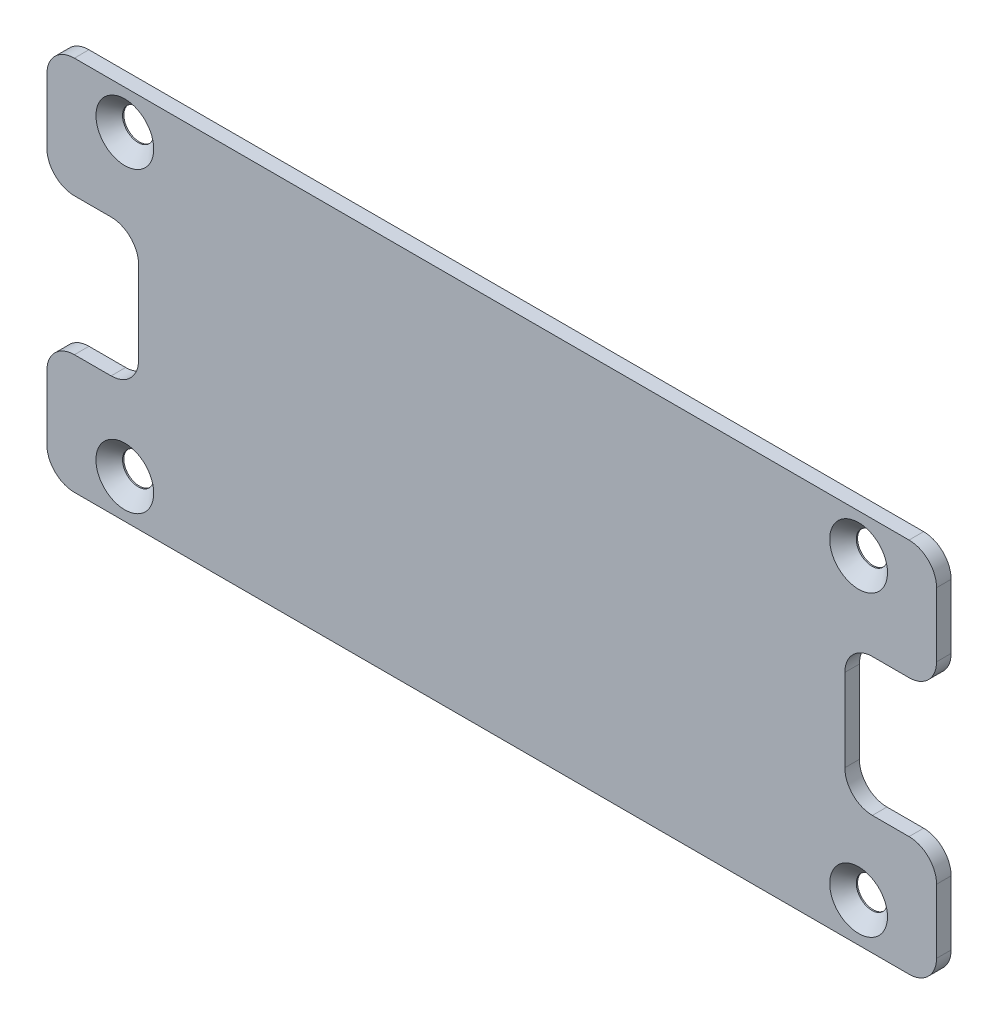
ISO-10303-21;
HEADER;
FILE_DESCRIPTION(('STEP AP214'),'2;1');
FILE_NAME('part.step','',(''),(''),'','','');
FILE_SCHEMA(('AUTOMOTIVE_DESIGN { 1 0 10303 214 1 1 1 1 }'));
ENDSEC;
DATA;
#1=APPLICATION_CONTEXT('core data for automotive mechanical design processes');
#2=APPLICATION_PROTOCOL_DEFINITION('international standard','automotive_design',2000,#1);
#3=PRODUCT_CONTEXT('',#1,'mechanical');
#4=PRODUCT('Part','Part','',(#3));
#5=PRODUCT_RELATED_PRODUCT_CATEGORY('part','',(#4));
#6=PRODUCT_DEFINITION_FORMATION('','',#4);
#7=PRODUCT_DEFINITION_CONTEXT('part definition',#1,'design');
#8=PRODUCT_DEFINITION('design','',#6,#7);
#9=PRODUCT_DEFINITION_SHAPE('','',#8);
#10=(LENGTH_UNIT() NAMED_UNIT(*) SI_UNIT(.MILLI.,.METRE.));
#11=(NAMED_UNIT(*) PLANE_ANGLE_UNIT() SI_UNIT($,.RADIAN.));
#12=(NAMED_UNIT(*) SI_UNIT($,.STERADIAN.) SOLID_ANGLE_UNIT());
#13=UNCERTAINTY_MEASURE_WITH_UNIT(LENGTH_MEASURE(1.E-05),#10,'distance_accuracy_value','');
#14=(GEOMETRIC_REPRESENTATION_CONTEXT(3) GLOBAL_UNCERTAINTY_ASSIGNED_CONTEXT((#13)) GLOBAL_UNIT_ASSIGNED_CONTEXT((#10,
#11,#12)) REPRESENTATION_CONTEXT('',''));
#15=CARTESIAN_POINT('',(0.,0.,0.));
#16=DIRECTION('',(0.,0.,1.));
#17=DIRECTION('',(1.,0.,0.));
#18=AXIS2_PLACEMENT_3D('',#15,#16,#17);
#19=CARTESIAN_POINT('',(48.5,-17.5,1.5875));
#20=DIRECTION('',(-1.,0.,0.));
#21=DIRECTION('',(0.,0.,1.));
#22=AXIS2_PLACEMENT_3D('',#19,#20,#21);
#23=PLANE('',#22);
#24=DIRECTION('',(0.,1.,0.));
#25=VECTOR('',#24,1.);
#26=CARTESIAN_POINT('',(48.5,-17.5,1.5875));
#27=LINE('',#26,#25);
#28=CARTESIAN_POINT('',(48.5,10.5,1.5875));
#29=VERTEX_POINT('',#28);
#30=CARTESIAN_POINT('',(48.5,17.5,1.5875));
#31=VERTEX_POINT('',#30);
#32=EDGE_CURVE('E209',#29,#31,#27,.T.);
#33=ORIENTED_EDGE('',*,*,#32,.F.);
#34=DIRECTION('',(0.,0.,1.));
#35=VECTOR('',#34,1.);
#36=CARTESIAN_POINT('',(48.5,10.5,1.5875));
#37=LINE('',#36,#35);
#38=CARTESIAN_POINT('',(48.5,10.5,0.));
#39=VERTEX_POINT('',#38);
#40=EDGE_CURVE('E277',#29,#39,#37,.F.);
#41=ORIENTED_EDGE('',*,*,#40,.T.);
#42=DIRECTION('',(0.,1.,0.));
#43=VECTOR('',#42,1.);
#44=CARTESIAN_POINT('',(48.5,-17.5,0.));
#45=LINE('',#44,#43);
#46=CARTESIAN_POINT('',(48.5,17.5,0.));
#47=VERTEX_POINT('',#46);
#48=EDGE_CURVE('E361',#39,#47,#45,.T.);
#49=ORIENTED_EDGE('',*,*,#48,.T.);
#50=DIRECTION('',(0.,0.,-1.));
#51=VECTOR('',#50,1.);
#52=CARTESIAN_POINT('',(48.5,17.5,1.5875));
#53=LINE('',#52,#51);
#54=EDGE_CURVE('E225',#31,#47,#53,.T.);
#55=ORIENTED_EDGE('',*,*,#54,.F.);
#56=EDGE_LOOP('',(#33,#41,#49,#55));
#57=FACE_BOUND('',#56,.T.);
#58=ADVANCED_FACE('F34',(#57),#23,.F.);
#59=CARTESIAN_POINT('',(-48.5,17.5,1.5875));
#60=DIRECTION('',(1.,0.,0.));
#61=DIRECTION('',(0.,0.,-1.));
#62=AXIS2_PLACEMENT_3D('',#59,#60,#61);
#63=PLANE('',#62);
#64=DIRECTION('',(0.,-1.,0.));
#65=VECTOR('',#64,1.);
#66=CARTESIAN_POINT('',(-48.5,17.5,0.));
#67=LINE('',#66,#65);
#68=CARTESIAN_POINT('',(-48.5,17.5,0.));
#69=VERTEX_POINT('',#68);
#70=CARTESIAN_POINT('',(-48.5,10.5,0.));
#71=VERTEX_POINT('',#70);
#72=EDGE_CURVE('E371',#69,#71,#67,.T.);
#73=ORIENTED_EDGE('',*,*,#72,.T.);
#74=DIRECTION('',(0.,0.,1.));
#75=VECTOR('',#74,1.);
#76=CARTESIAN_POINT('',(-48.5,10.5,1.5875));
#77=LINE('',#76,#75);
#78=CARTESIAN_POINT('',(-48.5,10.5,1.5875));
#79=VERTEX_POINT('',#78);
#80=EDGE_CURVE('E280',#71,#79,#77,.T.);
#81=ORIENTED_EDGE('',*,*,#80,.T.);
#82=DIRECTION('',(0.,-1.,0.));
#83=VECTOR('',#82,1.);
#84=CARTESIAN_POINT('',(-48.5,17.5,1.5875));
#85=LINE('',#84,#83);
#86=CARTESIAN_POINT('',(-48.5,17.5,1.5875));
#87=VERTEX_POINT('',#86);
#88=EDGE_CURVE('E353',#87,#79,#85,.T.);
#89=ORIENTED_EDGE('',*,*,#88,.F.);
#90=DIRECTION('',(0.,0.,-1.));
#91=VECTOR('',#90,1.);
#92=CARTESIAN_POINT('',(-48.5,17.5,1.5875));
#93=LINE('',#92,#91);
#94=EDGE_CURVE('E383',#87,#69,#93,.T.);
#95=ORIENTED_EDGE('',*,*,#94,.T.);
#96=EDGE_LOOP('',(#73,#81,#89,#95));
#97=FACE_BOUND('',#96,.T.);
#98=ADVANCED_FACE('F406',(#97),#63,.F.);
#99=CARTESIAN_POINT('',(45.5,-17.5,1.5875));
#100=DIRECTION('',(0.,0.,-1.));
#101=DIRECTION('',(-1.,0.,0.));
#102=AXIS2_PLACEMENT_3D('',#99,#100,#101);
#103=CYLINDRICAL_SURFACE('',#102,3.00000000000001);
#104=CARTESIAN_POINT('',(45.5,-17.5,0.));
#105=DIRECTION('',(0.,0.,1.));
#106=DIRECTION('',(1.,0.,0.));
#107=AXIS2_PLACEMENT_3D('',#104,#105,#106);
#108=CIRCLE('',#107,3.00000000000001);
#109=CARTESIAN_POINT('',(45.5,-20.5,0.));
#110=VERTEX_POINT('',#109);
#111=CARTESIAN_POINT('',(48.5,-17.5,0.));
#112=VERTEX_POINT('',#111);
#113=EDGE_CURVE('E223',#110,#112,#108,.T.);
#114=ORIENTED_EDGE('',*,*,#113,.T.);
#115=DIRECTION('',(0.,0.,-1.));
#116=VECTOR('',#115,1.);
#117=CARTESIAN_POINT('',(48.5,-17.5,1.5875));
#118=LINE('',#117,#116);
#119=CARTESIAN_POINT('',(48.5,-17.5,1.5875));
#120=VERTEX_POINT('',#119);
#121=EDGE_CURVE('E203',#120,#112,#118,.T.);
#122=ORIENTED_EDGE('',*,*,#121,.F.);
#123=CARTESIAN_POINT('',(45.5,-17.5,1.5875));
#124=DIRECTION('',(0.,0.,1.));
#125=DIRECTION('',(1.,0.,0.));
#126=AXIS2_PLACEMENT_3D('',#123,#124,#125);
#127=CIRCLE('',#126,3.00000000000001);
#128=CARTESIAN_POINT('',(45.5,-20.5,1.5875));
#129=VERTEX_POINT('',#128);
#130=EDGE_CURVE('E212',#129,#120,#127,.T.);
#131=ORIENTED_EDGE('',*,*,#130,.F.);
#132=DIRECTION('',(0.,0.,-1.));
#133=VECTOR('',#132,1.);
#134=CARTESIAN_POINT('',(45.5,-20.5,1.5875));
#135=LINE('',#134,#133);
#136=EDGE_CURVE('E359',#129,#110,#135,.T.);
#137=ORIENTED_EDGE('',*,*,#136,.T.);
#138=EDGE_LOOP('',(#114,#122,#131,#137));
#139=FACE_BOUND('',#138,.T.);
#140=ADVANCED_FACE('F221',(#139),#103,.T.);
#141=CARTESIAN_POINT('',(48.5,-10.5,0.));
#142=VERTEX_POINT('',#141);
#143=EDGE_CURVE('E362',#112,#142,#45,.T.);
#144=ORIENTED_EDGE('',*,*,#143,.T.);
#145=DIRECTION('',(0.,0.,1.));
#146=VECTOR('',#145,1.);
#147=CARTESIAN_POINT('',(48.5,-10.5,1.5875));
#148=LINE('',#147,#146);
#149=CARTESIAN_POINT('',(48.5,-10.5,1.5875));
#150=VERTEX_POINT('',#149);
#151=EDGE_CURVE('E206',#142,#150,#148,.T.);
#152=ORIENTED_EDGE('',*,*,#151,.T.);
#153=EDGE_CURVE('E198',#120,#150,#27,.T.);
#154=ORIENTED_EDGE('',*,*,#153,.F.);
#155=ORIENTED_EDGE('',*,*,#121,.T.);
#156=EDGE_LOOP('',(#144,#152,#154,#155));
#157=FACE_BOUND('',#156,.T.);
#158=ADVANCED_FACE('F201',(#157),#23,.F.);
#159=CARTESIAN_POINT('',(45.5,17.5,1.5875));
#160=DIRECTION('',(0.,0.,-1.));
#161=DIRECTION('',(-1.,0.,0.));
#162=AXIS2_PLACEMENT_3D('',#159,#160,#161);
#163=CYLINDRICAL_SURFACE('',#162,3.00000000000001);
#164=CARTESIAN_POINT('',(45.5,17.5,0.));
#165=DIRECTION('',(0.,0.,1.));
#166=DIRECTION('',(1.,0.,0.));
#167=AXIS2_PLACEMENT_3D('',#164,#165,#166);
#168=CIRCLE('',#167,3.00000000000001);
#169=CARTESIAN_POINT('',(45.5,20.5,0.));
#170=VERTEX_POINT('',#169);
#171=EDGE_CURVE('E364',#47,#170,#168,.T.);
#172=ORIENTED_EDGE('',*,*,#171,.T.);
#173=DIRECTION('',(0.,0.,-1.));
#174=VECTOR('',#173,1.);
#175=CARTESIAN_POINT('',(45.5,20.5,1.5875));
#176=LINE('',#175,#174);
#177=CARTESIAN_POINT('',(45.5,20.5,1.5875));
#178=VERTEX_POINT('',#177);
#179=EDGE_CURVE('E230',#178,#170,#176,.T.);
#180=ORIENTED_EDGE('',*,*,#179,.F.);
#181=CARTESIAN_POINT('',(45.5,17.5,1.5875));
#182=DIRECTION('',(0.,0.,1.));
#183=DIRECTION('',(1.,0.,0.));
#184=AXIS2_PLACEMENT_3D('',#181,#182,#183);
#185=CIRCLE('',#184,3.00000000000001);
#186=EDGE_CURVE('E208',#31,#178,#185,.T.);
#187=ORIENTED_EDGE('',*,*,#186,.F.);
#188=ORIENTED_EDGE('',*,*,#54,.T.);
#189=EDGE_LOOP('',(#172,#180,#187,#188));
#190=FACE_BOUND('',#189,.T.);
#191=ADVANCED_FACE('F411',(#190),#163,.T.);
#192=CARTESIAN_POINT('',(45.5,20.5,1.5875));
#193=DIRECTION('',(0.,-1.,0.));
#194=DIRECTION('',(0.,0.,-1.));
#195=AXIS2_PLACEMENT_3D('',#192,#193,#194);
#196=PLANE('',#195);
#197=DIRECTION('',(-1.,0.,0.));
#198=VECTOR('',#197,1.);
#199=CARTESIAN_POINT('',(45.5,20.5,0.));
#200=LINE('',#199,#198);
#201=CARTESIAN_POINT('',(-45.5,20.5,0.));
#202=VERTEX_POINT('',#201);
#203=EDGE_CURVE('E366',#170,#202,#200,.T.);
#204=ORIENTED_EDGE('',*,*,#203,.T.);
#205=DIRECTION('',(0.,0.,-1.));
#206=VECTOR('',#205,1.);
#207=CARTESIAN_POINT('',(-45.5,20.5,1.5875));
#208=LINE('',#207,#206);
#209=CARTESIAN_POINT('',(-45.5,20.5,1.5875));
#210=VERTEX_POINT('',#209);
#211=EDGE_CURVE('E386',#210,#202,#208,.T.);
#212=ORIENTED_EDGE('',*,*,#211,.F.);
#213=DIRECTION('',(-1.,0.,0.));
#214=VECTOR('',#213,1.);
#215=CARTESIAN_POINT('',(45.5,20.5,1.5875));
#216=LINE('',#215,#214);
#217=EDGE_CURVE('E348',#178,#210,#216,.T.);
#218=ORIENTED_EDGE('',*,*,#217,.F.);
#219=ORIENTED_EDGE('',*,*,#179,.T.);
#220=EDGE_LOOP('',(#204,#212,#218,#219));
#221=FACE_BOUND('',#220,.T.);
#222=ADVANCED_FACE('F393',(#221),#196,.F.);
#223=CARTESIAN_POINT('',(-45.5,17.5,1.5875));
#224=DIRECTION('',(0.,0.,-1.));
#225=DIRECTION('',(-1.,0.,0.));
#226=AXIS2_PLACEMENT_3D('',#223,#224,#225);
#227=CYLINDRICAL_SURFACE('',#226,3.00000000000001);
#228=CARTESIAN_POINT('',(-45.5,17.5,0.));
#229=DIRECTION('',(0.,0.,1.));
#230=DIRECTION('',(1.,0.,0.));
#231=AXIS2_PLACEMENT_3D('',#228,#229,#230);
#232=CIRCLE('',#231,3.00000000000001);
#233=EDGE_CURVE('E368',#202,#69,#232,.T.);
#234=ORIENTED_EDGE('',*,*,#233,.T.);
#235=ORIENTED_EDGE('',*,*,#94,.F.);
#236=CARTESIAN_POINT('',(-45.5,17.5,1.5875));
#237=DIRECTION('',(0.,0.,1.));
#238=DIRECTION('',(1.,0.,0.));
#239=AXIS2_PLACEMENT_3D('',#236,#237,#238);
#240=CIRCLE('',#239,3.00000000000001);
#241=EDGE_CURVE('E350',#210,#87,#240,.T.);
#242=ORIENTED_EDGE('',*,*,#241,.F.);
#243=ORIENTED_EDGE('',*,*,#211,.T.);
#244=EDGE_LOOP('',(#234,#235,#242,#243));
#245=FACE_BOUND('',#244,.T.);
#246=ADVANCED_FACE('F402',(#245),#227,.T.);
#247=CARTESIAN_POINT('',(-48.5,-10.5,1.5875));
#248=VERTEX_POINT('',#247);
#249=CARTESIAN_POINT('',(-48.5,-17.5,1.5875));
#250=VERTEX_POINT('',#249);
#251=EDGE_CURVE('E352',#248,#250,#85,.T.);
#252=ORIENTED_EDGE('',*,*,#251,.F.);
#253=DIRECTION('',(0.,0.,1.));
#254=VECTOR('',#253,1.);
#255=CARTESIAN_POINT('',(-48.5,-10.5,1.5875));
#256=LINE('',#255,#254);
#257=CARTESIAN_POINT('',(-48.5,-10.5,0.));
#258=VERTEX_POINT('',#257);
#259=EDGE_CURVE('E57',#248,#258,#256,.F.);
#260=ORIENTED_EDGE('',*,*,#259,.T.);
#261=CARTESIAN_POINT('',(-48.5,-17.5,0.));
#262=VERTEX_POINT('',#261);
#263=EDGE_CURVE('E370',#258,#262,#67,.T.);
#264=ORIENTED_EDGE('',*,*,#263,.T.);
#265=DIRECTION('',(0.,0.,-1.));
#266=VECTOR('',#265,1.);
#267=CARTESIAN_POINT('',(-48.5,-17.5,1.5875));
#268=LINE('',#267,#266);
#269=EDGE_CURVE('E380',#250,#262,#268,.T.);
#270=ORIENTED_EDGE('',*,*,#269,.F.);
#271=EDGE_LOOP('',(#252,#260,#264,#270));
#272=FACE_BOUND('',#271,.T.);
#273=ADVANCED_FACE('F498',(#272),#63,.F.);
#274=CARTESIAN_POINT('',(-45.5,-17.5,1.5875));
#275=DIRECTION('',(0.,0.,-1.));
#276=DIRECTION('',(-1.,0.,0.));
#277=AXIS2_PLACEMENT_3D('',#274,#275,#276);
#278=CYLINDRICAL_SURFACE('',#277,3.00000000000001);
#279=CARTESIAN_POINT('',(-45.5,-17.5,0.));
#280=DIRECTION('',(0.,0.,1.));
#281=DIRECTION('',(1.,0.,0.));
#282=AXIS2_PLACEMENT_3D('',#279,#280,#281);
#283=CIRCLE('',#282,3.00000000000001);
#284=CARTESIAN_POINT('',(-45.5,-20.5,0.));
#285=VERTEX_POINT('',#284);
#286=EDGE_CURVE('E373',#262,#285,#283,.T.);
#287=ORIENTED_EDGE('',*,*,#286,.T.);
#288=DIRECTION('',(0.,0.,-1.));
#289=VECTOR('',#288,1.);
#290=CARTESIAN_POINT('',(-45.5,-20.5,1.5875));
#291=LINE('',#290,#289);
#292=CARTESIAN_POINT('',(-45.5,-20.5,1.5875));
#293=VERTEX_POINT('',#292);
#294=EDGE_CURVE('E377',#293,#285,#291,.T.);
#295=ORIENTED_EDGE('',*,*,#294,.F.);
#296=CARTESIAN_POINT('',(-45.5,-17.5,1.5875));
#297=DIRECTION('',(0.,0.,1.));
#298=DIRECTION('',(1.,0.,0.));
#299=AXIS2_PLACEMENT_3D('',#296,#297,#298);
#300=CIRCLE('',#299,3.00000000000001);
#301=EDGE_CURVE('E356',#250,#293,#300,.T.);
#302=ORIENTED_EDGE('',*,*,#301,.F.);
#303=ORIENTED_EDGE('',*,*,#269,.T.);
#304=EDGE_LOOP('',(#287,#295,#302,#303));
#305=FACE_BOUND('',#304,.T.);
#306=ADVANCED_FACE('F558',(#305),#278,.T.);
#307=CARTESIAN_POINT('',(-45.5,-20.5,1.5875));
#308=DIRECTION('',(0.,1.,0.));
#309=DIRECTION('',(0.,0.,1.));
#310=AXIS2_PLACEMENT_3D('',#307,#308,#309);
#311=PLANE('',#310);
#312=DIRECTION('',(1.,0.,0.));
#313=VECTOR('',#312,1.);
#314=CARTESIAN_POINT('',(-45.5,-20.5,0.));
#315=LINE('',#314,#313);
#316=EDGE_CURVE('E219',#285,#110,#315,.T.);
#317=ORIENTED_EDGE('',*,*,#316,.T.);
#318=ORIENTED_EDGE('',*,*,#136,.F.);
#319=DIRECTION('',(1.,0.,0.));
#320=VECTOR('',#319,1.);
#321=CARTESIAN_POINT('',(-45.5,-20.5,1.5875));
#322=LINE('',#321,#320);
#323=EDGE_CURVE('E215',#293,#129,#322,.T.);
#324=ORIENTED_EDGE('',*,*,#323,.F.);
#325=ORIENTED_EDGE('',*,*,#294,.T.);
#326=EDGE_LOOP('',(#317,#318,#324,#325));
#327=FACE_BOUND('',#326,.T.);
#328=ADVANCED_FACE('F468',(#327),#311,.F.);
#329=CARTESIAN_POINT('',(45.5,-17.5,1.5875));
#330=DIRECTION('',(0.,0.,1.));
#331=DIRECTION('',(1.,0.,0.));
#332=AXIS2_PLACEMENT_3D('',#329,#330,#331);
#333=PLANE('',#332);
#334=CARTESIAN_POINT('',(-40.,16.25,1.5875));
#335=DIRECTION('',(0.,0.,1.));
#336=DIRECTION('',(1.,0.,0.));
#337=AXIS2_PLACEMENT_3D('',#334,#335,#336);
#338=CIRCLE('',#337,3.15);
#339=CARTESIAN_POINT('',(-36.85,16.25,1.5875));
#340=VERTEX_POINT('',#339);
#341=EDGE_CURVE('E460',#340,#340,#338,.T.);
#342=ORIENTED_EDGE('',*,*,#341,.F.);
#343=EDGE_LOOP('',(#342));
#344=FACE_BOUND('',#343,.T.);
#345=CARTESIAN_POINT('',(40.,16.25,1.5875));
#346=DIRECTION('',(0.,0.,1.));
#347=DIRECTION('',(1.,0.,0.));
#348=AXIS2_PLACEMENT_3D('',#345,#346,#347);
#349=CIRCLE('',#348,3.15);
#350=CARTESIAN_POINT('',(43.15,16.25,1.5875));
#351=VERTEX_POINT('',#350);
#352=EDGE_CURVE('E451',#351,#351,#349,.T.);
#353=ORIENTED_EDGE('',*,*,#352,.F.);
#354=EDGE_LOOP('',(#353));
#355=FACE_BOUND('',#354,.T.);
#356=CARTESIAN_POINT('',(40.,-16.25,1.5875));
#357=DIRECTION('',(0.,0.,1.));
#358=DIRECTION('',(1.,0.,0.));
#359=AXIS2_PLACEMENT_3D('',#356,#357,#358);
#360=CIRCLE('',#359,3.15);
#361=CARTESIAN_POINT('',(43.15,-16.25,1.5875));
#362=VERTEX_POINT('',#361);
#363=EDGE_CURVE('E442',#362,#362,#360,.T.);
#364=ORIENTED_EDGE('',*,*,#363,.F.);
#365=EDGE_LOOP('',(#364));
#366=FACE_BOUND('',#365,.T.);
#367=CARTESIAN_POINT('',(-40.,-16.25,1.5875));
#368=DIRECTION('',(0.,0.,1.));
#369=DIRECTION('',(1.,0.,0.));
#370=AXIS2_PLACEMENT_3D('',#367,#368,#369);
#371=CIRCLE('',#370,3.15);
#372=CARTESIAN_POINT('',(-36.85,-16.25,1.5875));
#373=VERTEX_POINT('',#372);
#374=EDGE_CURVE('E433',#373,#373,#371,.T.);
#375=ORIENTED_EDGE('',*,*,#374,.F.);
#376=EDGE_LOOP('',(#375));
#377=FACE_BOUND('',#376,.T.);
#378=ORIENTED_EDGE('',*,*,#153,.T.);
#379=CARTESIAN_POINT('',(45.5,-10.5,1.5875));
#380=DIRECTION('',(0.,0.,1.));
#381=DIRECTION('',(1.,0.,0.));
#382=AXIS2_PLACEMENT_3D('',#379,#380,#381);
#383=CIRCLE('',#382,3.);
#384=CARTESIAN_POINT('',(45.5,-7.50000000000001,1.5875));
#385=VERTEX_POINT('',#384);
#386=EDGE_CURVE('E268',#150,#385,#383,.T.);
#387=ORIENTED_EDGE('',*,*,#386,.T.);
#388=DIRECTION('',(1.,0.,0.));
#389=VECTOR('',#388,1.);
#390=CARTESIAN_POINT('',(48.5,-7.50000000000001,1.5875));
#391=LINE('',#390,#389);
#392=CARTESIAN_POINT('',(41.5,-7.50000000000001,1.5875));
#393=VERTEX_POINT('',#392);
#394=EDGE_CURVE('E299',#393,#385,#391,.T.);
#395=ORIENTED_EDGE('',*,*,#394,.F.);
#396=CARTESIAN_POINT('',(41.5,-4.50000000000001,1.5875));
#397=DIRECTION('',(0.,0.,1.));
#398=DIRECTION('',(1.,0.,0.));
#399=AXIS2_PLACEMENT_3D('',#396,#397,#398);
#400=CIRCLE('',#399,3.);
#401=CARTESIAN_POINT('',(38.5,-4.50000000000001,1.5875));
#402=VERTEX_POINT('',#401);
#403=EDGE_CURVE('E42',#393,#402,#400,.F.);
#404=ORIENTED_EDGE('',*,*,#403,.T.);
#405=DIRECTION('',(0.,-1.,0.));
#406=VECTOR('',#405,1.);
#407=CARTESIAN_POINT('',(38.5,7.50000000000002,1.5875));
#408=LINE('',#407,#406);
#409=CARTESIAN_POINT('',(38.5,4.50000000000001,1.5875));
#410=VERTEX_POINT('',#409);
#411=EDGE_CURVE('E297',#410,#402,#408,.T.);
#412=ORIENTED_EDGE('',*,*,#411,.F.);
#413=CARTESIAN_POINT('',(41.5,4.50000000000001,1.5875));
#414=DIRECTION('',(0.,0.,1.));
#415=DIRECTION('',(1.,0.,0.));
#416=AXIS2_PLACEMENT_3D('',#413,#414,#415);
#417=CIRCLE('',#416,3.);
#418=CARTESIAN_POINT('',(41.5,7.50000000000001,1.5875));
#419=VERTEX_POINT('',#418);
#420=EDGE_CURVE('E291',#410,#419,#417,.F.);
#421=ORIENTED_EDGE('',*,*,#420,.T.);
#422=DIRECTION('',(-1.,0.,0.));
#423=VECTOR('',#422,1.);
#424=CARTESIAN_POINT('',(48.5,7.5,1.5875));
#425=LINE('',#424,#423);
#426=CARTESIAN_POINT('',(45.5,7.5,1.5875));
#427=VERTEX_POINT('',#426);
#428=EDGE_CURVE('E308',#427,#419,#425,.T.);
#429=ORIENTED_EDGE('',*,*,#428,.F.);
#430=CARTESIAN_POINT('',(45.5,10.5,1.5875));
#431=DIRECTION('',(0.,0.,1.));
#432=DIRECTION('',(1.,0.,0.));
#433=AXIS2_PLACEMENT_3D('',#430,#431,#432);
#434=CIRCLE('',#433,3.);
#435=EDGE_CURVE('E266',#427,#29,#434,.T.);
#436=ORIENTED_EDGE('',*,*,#435,.T.);
#437=ORIENTED_EDGE('',*,*,#32,.T.);
#438=ORIENTED_EDGE('',*,*,#186,.T.);
#439=ORIENTED_EDGE('',*,*,#217,.T.);
#440=ORIENTED_EDGE('',*,*,#241,.T.);
#441=ORIENTED_EDGE('',*,*,#88,.T.);
#442=CARTESIAN_POINT('',(-45.5,10.5,1.5875));
#443=DIRECTION('',(0.,0.,1.));
#444=DIRECTION('',(1.,0.,0.));
#445=AXIS2_PLACEMENT_3D('',#442,#443,#444);
#446=CIRCLE('',#445,3.);
#447=CARTESIAN_POINT('',(-45.5,7.49999999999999,1.5875));
#448=VERTEX_POINT('',#447);
#449=EDGE_CURVE('E262',#79,#448,#446,.T.);
#450=ORIENTED_EDGE('',*,*,#449,.T.);
#451=DIRECTION('',(-1.,0.,0.));
#452=VECTOR('',#451,1.);
#453=CARTESIAN_POINT('',(-48.5,7.5,1.5875));
#454=LINE('',#453,#452);
#455=CARTESIAN_POINT('',(-41.5,7.49999999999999,1.5875));
#456=VERTEX_POINT('',#455);
#457=EDGE_CURVE('E338',#456,#448,#454,.T.);
#458=ORIENTED_EDGE('',*,*,#457,.F.);
#459=CARTESIAN_POINT('',(-41.5,4.49999999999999,1.5875));
#460=DIRECTION('',(0.,0.,1.));
#461=DIRECTION('',(1.,0.,0.));
#462=AXIS2_PLACEMENT_3D('',#459,#460,#461);
#463=CIRCLE('',#462,3.);
#464=CARTESIAN_POINT('',(-38.5,4.49999999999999,1.5875));
#465=VERTEX_POINT('',#464);
#466=EDGE_CURVE('E287',#456,#465,#463,.F.);
#467=ORIENTED_EDGE('',*,*,#466,.T.);
#468=DIRECTION('',(0.,1.,0.));
#469=VECTOR('',#468,1.);
#470=CARTESIAN_POINT('',(-38.5,7.49999999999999,1.5875));
#471=LINE('',#470,#469);
#472=CARTESIAN_POINT('',(-38.5,-4.50000000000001,1.5875));
#473=VERTEX_POINT('',#472);
#474=EDGE_CURVE('E324',#473,#465,#471,.T.);
#475=ORIENTED_EDGE('',*,*,#474,.F.);
#476=CARTESIAN_POINT('',(-41.5,-4.50000000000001,1.5875));
#477=DIRECTION('',(0.,0.,1.));
#478=DIRECTION('',(1.,0.,0.));
#479=AXIS2_PLACEMENT_3D('',#476,#477,#478);
#480=CIRCLE('',#479,3.);
#481=CARTESIAN_POINT('',(-41.5,-7.50000000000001,1.5875));
#482=VERTEX_POINT('',#481);
#483=EDGE_CURVE('E283',#473,#482,#480,.F.);
#484=ORIENTED_EDGE('',*,*,#483,.T.);
#485=DIRECTION('',(1.,0.,0.));
#486=VECTOR('',#485,1.);
#487=CARTESIAN_POINT('',(-48.5,-7.50000000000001,1.5875));
#488=LINE('',#487,#486);
#489=CARTESIAN_POINT('',(-45.5,-7.50000000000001,1.5875));
#490=VERTEX_POINT('',#489);
#491=EDGE_CURVE('E321',#490,#482,#488,.T.);
#492=ORIENTED_EDGE('',*,*,#491,.F.);
#493=CARTESIAN_POINT('',(-45.5,-10.5,1.5875));
#494=DIRECTION('',(0.,0.,1.));
#495=DIRECTION('',(1.,0.,0.));
#496=AXIS2_PLACEMENT_3D('',#493,#494,#495);
#497=CIRCLE('',#496,3.);
#498=EDGE_CURVE('E264',#490,#248,#497,.T.);
#499=ORIENTED_EDGE('',*,*,#498,.T.);
#500=ORIENTED_EDGE('',*,*,#251,.T.);
#501=ORIENTED_EDGE('',*,*,#301,.T.);
#502=ORIENTED_EDGE('',*,*,#323,.T.);
#503=ORIENTED_EDGE('',*,*,#130,.T.);
#504=EDGE_LOOP('',(#378,#387,#395,#404,#412,#421,#429,#436,#437,#438,#439,#440,#441,#450,#458,
#467,#475,#484,#492,#499,#500,#501,#502,#503));
#505=FACE_BOUND('',#504,.T.);
#506=ADVANCED_FACE('F213',(#344,#355,#366,#377,#505),#333,.T.);
#507=CARTESIAN_POINT('',(45.5,-17.5,0.));
#508=DIRECTION('',(0.,0.,1.));
#509=DIRECTION('',(1.,0.,0.));
#510=AXIS2_PLACEMENT_3D('',#507,#508,#509);
#511=PLANE('',#510);
#512=CARTESIAN_POINT('',(-40.,16.25,0.));
#513=DIRECTION('',(0.,0.,1.));
#514=DIRECTION('',(1.,0.,0.));
#515=AXIS2_PLACEMENT_3D('',#512,#513,#514);
#516=CIRCLE('',#515,1.7);
#517=CARTESIAN_POINT('',(-38.3,16.25,0.));
#518=VERTEX_POINT('',#517);
#519=EDGE_CURVE('E454',#518,#518,#516,.T.);
#520=ORIENTED_EDGE('',*,*,#519,.T.);
#521=EDGE_LOOP('',(#520));
#522=FACE_BOUND('',#521,.T.);
#523=CARTESIAN_POINT('',(40.,16.25,0.));
#524=DIRECTION('',(0.,0.,1.));
#525=DIRECTION('',(1.,0.,0.));
#526=AXIS2_PLACEMENT_3D('',#523,#524,#525);
#527=CIRCLE('',#526,1.7);
#528=CARTESIAN_POINT('',(41.7,16.25,0.));
#529=VERTEX_POINT('',#528);
#530=EDGE_CURVE('E445',#529,#529,#527,.T.);
#531=ORIENTED_EDGE('',*,*,#530,.T.);
#532=EDGE_LOOP('',(#531));
#533=FACE_BOUND('',#532,.T.);
#534=CARTESIAN_POINT('',(40.,-16.25,0.));
#535=DIRECTION('',(0.,0.,1.));
#536=DIRECTION('',(1.,0.,0.));
#537=AXIS2_PLACEMENT_3D('',#534,#535,#536);
#538=CIRCLE('',#537,1.7);
#539=CARTESIAN_POINT('',(41.7,-16.25,0.));
#540=VERTEX_POINT('',#539);
#541=EDGE_CURVE('E436',#540,#540,#538,.T.);
#542=ORIENTED_EDGE('',*,*,#541,.T.);
#543=EDGE_LOOP('',(#542));
#544=FACE_BOUND('',#543,.T.);
#545=CARTESIAN_POINT('',(-40.,-16.25,0.));
#546=DIRECTION('',(0.,0.,1.));
#547=DIRECTION('',(1.,0.,0.));
#548=AXIS2_PLACEMENT_3D('',#545,#546,#547);
#549=CIRCLE('',#548,1.7);
#550=CARTESIAN_POINT('',(-38.3,-16.25,0.));
#551=VERTEX_POINT('',#550);
#552=EDGE_CURVE('E331',#551,#551,#549,.T.);
#553=ORIENTED_EDGE('',*,*,#552,.T.);
#554=EDGE_LOOP('',(#553));
#555=FACE_BOUND('',#554,.T.);
#556=DIRECTION('',(1.,0.,0.));
#557=VECTOR('',#556,1.);
#558=CARTESIAN_POINT('',(48.5,-7.50000000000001,0.));
#559=LINE('',#558,#557);
#560=CARTESIAN_POINT('',(41.5,-7.50000000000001,0.));
#561=VERTEX_POINT('',#560);
#562=CARTESIAN_POINT('',(45.5,-7.50000000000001,0.));
#563=VERTEX_POINT('',#562);
#564=EDGE_CURVE('E315',#561,#563,#559,.T.);
#565=ORIENTED_EDGE('',*,*,#564,.T.);
#566=CARTESIAN_POINT('',(45.5,-10.5,0.));
#567=DIRECTION('',(0.,0.,1.));
#568=DIRECTION('',(1.,0.,0.));
#569=AXIS2_PLACEMENT_3D('',#566,#567,#568);
#570=CIRCLE('',#569,3.);
#571=EDGE_CURVE('E275',#563,#142,#570,.F.);
#572=ORIENTED_EDGE('',*,*,#571,.T.);
#573=ORIENTED_EDGE('',*,*,#143,.F.);
#574=ORIENTED_EDGE('',*,*,#113,.F.);
#575=ORIENTED_EDGE('',*,*,#316,.F.);
#576=ORIENTED_EDGE('',*,*,#286,.F.);
#577=ORIENTED_EDGE('',*,*,#263,.F.);
#578=CARTESIAN_POINT('',(-45.5,-10.5,0.));
#579=DIRECTION('',(0.,0.,1.));
#580=DIRECTION('',(1.,0.,0.));
#581=AXIS2_PLACEMENT_3D('',#578,#579,#580);
#582=CIRCLE('',#581,3.);
#583=CARTESIAN_POINT('',(-45.5,-7.50000000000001,0.));
#584=VERTEX_POINT('',#583);
#585=EDGE_CURVE('E271',#258,#584,#582,.F.);
#586=ORIENTED_EDGE('',*,*,#585,.T.);
#587=DIRECTION('',(1.,0.,0.));
#588=VECTOR('',#587,1.);
#589=CARTESIAN_POINT('',(-48.5,-7.50000000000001,0.));
#590=LINE('',#589,#588);
#591=CARTESIAN_POINT('',(-41.5,-7.50000000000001,0.));
#592=VERTEX_POINT('',#591);
#593=EDGE_CURVE('E334',#584,#592,#590,.T.);
#594=ORIENTED_EDGE('',*,*,#593,.T.);
#595=CARTESIAN_POINT('',(-41.5,-4.50000000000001,0.));
#596=DIRECTION('',(0.,0.,1.));
#597=DIRECTION('',(1.,0.,0.));
#598=AXIS2_PLACEMENT_3D('',#595,#596,#597);
#599=CIRCLE('',#598,3.);
#600=CARTESIAN_POINT('',(-38.5,-4.50000000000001,0.));
#601=VERTEX_POINT('',#600);
#602=EDGE_CURVE('E285',#592,#601,#599,.T.);
#603=ORIENTED_EDGE('',*,*,#602,.T.);
#604=DIRECTION('',(0.,1.,0.));
#605=VECTOR('',#604,1.);
#606=CARTESIAN_POINT('',(-38.5,7.49999999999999,0.));
#607=LINE('',#606,#605);
#608=CARTESIAN_POINT('',(-38.5,4.49999999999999,0.));
#609=VERTEX_POINT('',#608);
#610=EDGE_CURVE('E337',#601,#609,#607,.T.);
#611=ORIENTED_EDGE('',*,*,#610,.T.);
#612=CARTESIAN_POINT('',(-41.5,4.49999999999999,0.));
#613=DIRECTION('',(0.,0.,1.));
#614=DIRECTION('',(1.,0.,0.));
#615=AXIS2_PLACEMENT_3D('',#612,#613,#614);
#616=CIRCLE('',#615,3.);
#617=CARTESIAN_POINT('',(-41.5,7.49999999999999,0.));
#618=VERTEX_POINT('',#617);
#619=EDGE_CURVE('E289',#609,#618,#616,.T.);
#620=ORIENTED_EDGE('',*,*,#619,.T.);
#621=DIRECTION('',(-1.,0.,0.));
#622=VECTOR('',#621,1.);
#623=CARTESIAN_POINT('',(-48.5,7.5,0.));
#624=LINE('',#623,#622);
#625=CARTESIAN_POINT('',(-45.5,7.49999999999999,0.));
#626=VERTEX_POINT('',#625);
#627=EDGE_CURVE('E341',#618,#626,#624,.T.);
#628=ORIENTED_EDGE('',*,*,#627,.T.);
#629=CARTESIAN_POINT('',(-45.5,10.5,0.));
#630=DIRECTION('',(0.,0.,1.));
#631=DIRECTION('',(1.,0.,0.));
#632=AXIS2_PLACEMENT_3D('',#629,#630,#631);
#633=CIRCLE('',#632,3.);
#634=EDGE_CURVE('E49',#626,#71,#633,.F.);
#635=ORIENTED_EDGE('',*,*,#634,.T.);
#636=ORIENTED_EDGE('',*,*,#72,.F.);
#637=ORIENTED_EDGE('',*,*,#233,.F.);
#638=ORIENTED_EDGE('',*,*,#203,.F.);
#639=ORIENTED_EDGE('',*,*,#171,.F.);
#640=ORIENTED_EDGE('',*,*,#48,.F.);
#641=CARTESIAN_POINT('',(45.5,10.5,0.));
#642=DIRECTION('',(0.,0.,1.));
#643=DIRECTION('',(1.,0.,0.));
#644=AXIS2_PLACEMENT_3D('',#641,#642,#643);
#645=CIRCLE('',#644,3.);
#646=CARTESIAN_POINT('',(45.5,7.5,0.));
#647=VERTEX_POINT('',#646);
#648=EDGE_CURVE('E273',#39,#647,#645,.F.);
#649=ORIENTED_EDGE('',*,*,#648,.T.);
#650=DIRECTION('',(-1.,0.,0.));
#651=VECTOR('',#650,1.);
#652=CARTESIAN_POINT('',(48.5,7.5,0.));
#653=LINE('',#652,#651);
#654=CARTESIAN_POINT('',(41.5,7.50000000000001,0.));
#655=VERTEX_POINT('',#654);
#656=EDGE_CURVE('E326',#647,#655,#653,.T.);
#657=ORIENTED_EDGE('',*,*,#656,.T.);
#658=CARTESIAN_POINT('',(41.5,4.50000000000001,0.));
#659=DIRECTION('',(0.,0.,1.));
#660=DIRECTION('',(1.,0.,0.));
#661=AXIS2_PLACEMENT_3D('',#658,#659,#660);
#662=CIRCLE('',#661,3.);
#663=CARTESIAN_POINT('',(38.5,4.50000000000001,0.));
#664=VERTEX_POINT('',#663);
#665=EDGE_CURVE('E293',#655,#664,#662,.T.);
#666=ORIENTED_EDGE('',*,*,#665,.T.);
#667=DIRECTION('',(0.,-1.,0.));
#668=VECTOR('',#667,1.);
#669=CARTESIAN_POINT('',(38.5,7.50000000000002,0.));
#670=LINE('',#669,#668);
#671=CARTESIAN_POINT('',(38.5,-4.50000000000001,0.));
#672=VERTEX_POINT('',#671);
#673=EDGE_CURVE('E317',#664,#672,#670,.T.);
#674=ORIENTED_EDGE('',*,*,#673,.T.);
#675=CARTESIAN_POINT('',(41.5,-4.50000000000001,0.));
#676=DIRECTION('',(0.,0.,1.));
#677=DIRECTION('',(1.,0.,0.));
#678=AXIS2_PLACEMENT_3D('',#675,#676,#677);
#679=CIRCLE('',#678,3.);
#680=EDGE_CURVE('E11',#672,#561,#679,.T.);
#681=ORIENTED_EDGE('',*,*,#680,.T.);
#682=EDGE_LOOP('',(#565,#572,#573,#574,#575,#576,#577,#586,#594,#603,#611,#620,#628,#635,#636,
#637,#638,#639,#640,#649,#657,#666,#674,#681));
#683=FACE_BOUND('',#682,.T.);
#684=ADVANCED_FACE('F314',(#522,#533,#544,#555,#683),#511,.F.);
#685=CARTESIAN_POINT('',(-48.5,7.5,0.));
#686=DIRECTION('',(0.,1.,0.));
#687=DIRECTION('',(-1.,0.,0.));
#688=AXIS2_PLACEMENT_3D('',#685,#686,#687);
#689=PLANE('',#688);
#690=ORIENTED_EDGE('',*,*,#627,.F.);
#691=DIRECTION('',(0.,0.,1.));
#692=VECTOR('',#691,1.);
#693=CARTESIAN_POINT('',(-41.5,7.49999999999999,1.5875));
#694=LINE('',#693,#692);
#695=EDGE_CURVE('E243',#618,#456,#694,.T.);
#696=ORIENTED_EDGE('',*,*,#695,.T.);
#697=ORIENTED_EDGE('',*,*,#457,.T.);
#698=DIRECTION('',(0.,0.,1.));
#699=VECTOR('',#698,1.);
#700=CARTESIAN_POINT('',(-45.5,7.49999999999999,0.));
#701=LINE('',#700,#699);
#702=EDGE_CURVE('E241',#448,#626,#701,.F.);
#703=ORIENTED_EDGE('',*,*,#702,.T.);
#704=EDGE_LOOP('',(#690,#696,#697,#703));
#705=FACE_BOUND('',#704,.T.);
#706=ADVANCED_FACE('F552',(#705),#689,.F.);
#707=CARTESIAN_POINT('',(-38.5,7.49999999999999,0.));
#708=DIRECTION('',(1.,0.,0.));
#709=DIRECTION('',(0.,0.,-1.));
#710=AXIS2_PLACEMENT_3D('',#707,#708,#709);
#711=PLANE('',#710);
#712=ORIENTED_EDGE('',*,*,#610,.F.);
#713=DIRECTION('',(0.,0.,1.));
#714=VECTOR('',#713,1.);
#715=CARTESIAN_POINT('',(-38.5,-4.50000000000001,1.5875));
#716=LINE('',#715,#714);
#717=EDGE_CURVE('E227',#601,#473,#716,.T.);
#718=ORIENTED_EDGE('',*,*,#717,.T.);
#719=ORIENTED_EDGE('',*,*,#474,.T.);
#720=DIRECTION('',(0.,0.,1.));
#721=VECTOR('',#720,1.);
#722=CARTESIAN_POINT('',(-38.5,4.49999999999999,0.));
#723=LINE('',#722,#721);
#724=EDGE_CURVE('E224',#465,#609,#723,.F.);
#725=ORIENTED_EDGE('',*,*,#724,.T.);
#726=EDGE_LOOP('',(#712,#718,#719,#725));
#727=FACE_BOUND('',#726,.T.);
#728=ADVANCED_FACE('F546',(#727),#711,.F.);
#729=CARTESIAN_POINT('',(-48.5,-7.50000000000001,0.));
#730=DIRECTION('',(0.,-1.,0.));
#731=DIRECTION('',(0.,0.,-1.));
#732=AXIS2_PLACEMENT_3D('',#729,#730,#731);
#733=PLANE('',#732);
#734=ORIENTED_EDGE('',*,*,#491,.T.);
#735=DIRECTION('',(0.,0.,1.));
#736=VECTOR('',#735,1.);
#737=CARTESIAN_POINT('',(-41.5,-7.50000000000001,0.));
#738=LINE('',#737,#736);
#739=EDGE_CURVE('E239',#482,#592,#738,.F.);
#740=ORIENTED_EDGE('',*,*,#739,.T.);
#741=ORIENTED_EDGE('',*,*,#593,.F.);
#742=DIRECTION('',(0.,0.,1.));
#743=VECTOR('',#742,1.);
#744=CARTESIAN_POINT('',(-45.5,-7.50000000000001,0.));
#745=LINE('',#744,#743);
#746=EDGE_CURVE('E236',#584,#490,#745,.T.);
#747=ORIENTED_EDGE('',*,*,#746,.T.);
#748=EDGE_LOOP('',(#734,#740,#741,#747));
#749=FACE_BOUND('',#748,.T.);
#750=ADVANCED_FACE('F539',(#749),#733,.F.);
#751=CARTESIAN_POINT('',(48.5,7.5,0.));
#752=DIRECTION('',(0.,1.,0.));
#753=DIRECTION('',(-1.,0.,0.));
#754=AXIS2_PLACEMENT_3D('',#751,#752,#753);
#755=PLANE('',#754);
#756=ORIENTED_EDGE('',*,*,#428,.T.);
#757=DIRECTION('',(0.,0.,1.));
#758=VECTOR('',#757,1.);
#759=CARTESIAN_POINT('',(41.5,7.50000000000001,0.));
#760=LINE('',#759,#758);
#761=EDGE_CURVE('E254',#419,#655,#760,.F.);
#762=ORIENTED_EDGE('',*,*,#761,.T.);
#763=ORIENTED_EDGE('',*,*,#656,.F.);
#764=DIRECTION('',(0.,0.,1.));
#765=VECTOR('',#764,1.);
#766=CARTESIAN_POINT('',(45.5,7.5,0.));
#767=LINE('',#766,#765);
#768=EDGE_CURVE('E251',#647,#427,#767,.T.);
#769=ORIENTED_EDGE('',*,*,#768,.T.);
#770=EDGE_LOOP('',(#756,#762,#763,#769));
#771=FACE_BOUND('',#770,.T.);
#772=ADVANCED_FACE('F422',(#771),#755,.F.);
#773=CARTESIAN_POINT('',(48.5,-7.50000000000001,0.));
#774=DIRECTION('',(0.,-1.,0.));
#775=DIRECTION('',(0.,0.,-1.));
#776=AXIS2_PLACEMENT_3D('',#773,#774,#775);
#777=PLANE('',#776);
#778=ORIENTED_EDGE('',*,*,#564,.F.);
#779=DIRECTION('',(0.,0.,1.));
#780=VECTOR('',#779,1.);
#781=CARTESIAN_POINT('',(41.5,-7.50000000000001,1.5875));
#782=LINE('',#781,#780);
#783=EDGE_CURVE('E258',#561,#393,#782,.T.);
#784=ORIENTED_EDGE('',*,*,#783,.T.);
#785=ORIENTED_EDGE('',*,*,#394,.T.);
#786=DIRECTION('',(0.,0.,1.));
#787=VECTOR('',#786,1.);
#788=CARTESIAN_POINT('',(45.5,-7.50000000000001,0.));
#789=LINE('',#788,#787);
#790=EDGE_CURVE('E256',#385,#563,#789,.F.);
#791=ORIENTED_EDGE('',*,*,#790,.T.);
#792=EDGE_LOOP('',(#778,#784,#785,#791));
#793=FACE_BOUND('',#792,.T.);
#794=ADVANCED_FACE('F319',(#793),#777,.F.);
#795=CARTESIAN_POINT('',(38.5,7.50000000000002,0.));
#796=DIRECTION('',(-1.,0.,0.));
#797=DIRECTION('',(0.,0.,1.));
#798=AXIS2_PLACEMENT_3D('',#795,#796,#797);
#799=PLANE('',#798);
#800=ORIENTED_EDGE('',*,*,#673,.F.);
#801=DIRECTION('',(0.,0.,1.));
#802=VECTOR('',#801,1.);
#803=CARTESIAN_POINT('',(38.5,4.50000000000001,1.5875));
#804=LINE('',#803,#802);
#805=EDGE_CURVE('E248',#664,#410,#804,.T.);
#806=ORIENTED_EDGE('',*,*,#805,.T.);
#807=ORIENTED_EDGE('',*,*,#411,.T.);
#808=DIRECTION('',(0.,0.,1.));
#809=VECTOR('',#808,1.);
#810=CARTESIAN_POINT('',(38.5,-4.50000000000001,0.));
#811=LINE('',#810,#809);
#812=EDGE_CURVE('E246',#402,#672,#811,.F.);
#813=ORIENTED_EDGE('',*,*,#812,.T.);
#814=EDGE_LOOP('',(#800,#806,#807,#813));
#815=FACE_BOUND('',#814,.T.);
#816=ADVANCED_FACE('F305',(#815),#799,.F.);
#817=CARTESIAN_POINT('',(-40.,-16.25,1.5875));
#818=DIRECTION('',(0.,0.,1.));
#819=DIRECTION('',(1.,0.,0.));
#820=AXIS2_PLACEMENT_3D('',#817,#818,#819);
#821=CYLINDRICAL_SURFACE('',#820,1.7);
#822=ORIENTED_EDGE('',*,*,#552,.F.);
#823=EDGE_LOOP('',(#822));
#824=FACE_BOUND('',#823,.T.);
#825=CARTESIAN_POINT('',(-40.,-16.25,0.137500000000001));
#826=DIRECTION('',(0.,0.,1.));
#827=DIRECTION('',(1.,0.,0.));
#828=AXIS2_PLACEMENT_3D('',#825,#826,#827);
#829=CIRCLE('',#828,1.7);
#830=CARTESIAN_POINT('',(-38.3,-16.25,0.137500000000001));
#831=VERTEX_POINT('',#830);
#832=EDGE_CURVE('E430',#831,#831,#829,.T.);
#833=ORIENTED_EDGE('',*,*,#832,.T.);
#834=EDGE_LOOP('',(#833));
#835=FACE_BOUND('',#834,.T.);
#836=ADVANCED_FACE('F479',(#824,#835),#821,.F.);
#837=CARTESIAN_POINT('',(-40.,-16.25,1.5875));
#838=DIRECTION('',(0.,0.,1.));
#839=DIRECTION('',(1.,0.,0.));
#840=AXIS2_PLACEMENT_3D('',#837,#838,#839);
#841=CONICAL_SURFACE('',#840,3.15,0.785398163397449);
#842=ORIENTED_EDGE('',*,*,#832,.F.);
#843=EDGE_LOOP('',(#842));
#844=FACE_BOUND('',#843,.T.);
#845=ORIENTED_EDGE('',*,*,#374,.T.);
#846=EDGE_LOOP('',(#845));
#847=FACE_BOUND('',#846,.T.);
#848=ADVANCED_FACE('F476',(#844,#847),#841,.F.);
#849=CARTESIAN_POINT('',(40.,-16.25,1.5875));
#850=DIRECTION('',(0.,0.,1.));
#851=DIRECTION('',(1.,0.,0.));
#852=AXIS2_PLACEMENT_3D('',#849,#850,#851);
#853=CYLINDRICAL_SURFACE('',#852,1.7);
#854=ORIENTED_EDGE('',*,*,#541,.F.);
#855=EDGE_LOOP('',(#854));
#856=FACE_BOUND('',#855,.T.);
#857=CARTESIAN_POINT('',(40.,-16.25,0.137500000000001));
#858=DIRECTION('',(0.,0.,1.));
#859=DIRECTION('',(1.,0.,0.));
#860=AXIS2_PLACEMENT_3D('',#857,#858,#859);
#861=CIRCLE('',#860,1.7);
#862=CARTESIAN_POINT('',(41.7,-16.25,0.137500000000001));
#863=VERTEX_POINT('',#862);
#864=EDGE_CURVE('E439',#863,#863,#861,.T.);
#865=ORIENTED_EDGE('',*,*,#864,.T.);
#866=EDGE_LOOP('',(#865));
#867=FACE_BOUND('',#866,.T.);
#868=ADVANCED_FACE('F478',(#856,#867),#853,.F.);
#869=CARTESIAN_POINT('',(40.,-16.25,1.5875));
#870=DIRECTION('',(0.,0.,1.));
#871=DIRECTION('',(1.,0.,0.));
#872=AXIS2_PLACEMENT_3D('',#869,#870,#871);
#873=CONICAL_SURFACE('',#872,3.15,0.785398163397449);
#874=ORIENTED_EDGE('',*,*,#864,.F.);
#875=EDGE_LOOP('',(#874));
#876=FACE_BOUND('',#875,.T.);
#877=ORIENTED_EDGE('',*,*,#363,.T.);
#878=EDGE_LOOP('',(#877));
#879=FACE_BOUND('',#878,.T.);
#880=ADVANCED_FACE('F486',(#876,#879),#873,.F.);
#881=CARTESIAN_POINT('',(40.,16.25,1.5875));
#882=DIRECTION('',(0.,0.,1.));
#883=DIRECTION('',(1.,0.,0.));
#884=AXIS2_PLACEMENT_3D('',#881,#882,#883);
#885=CYLINDRICAL_SURFACE('',#884,1.7);
#886=ORIENTED_EDGE('',*,*,#530,.F.);
#887=EDGE_LOOP('',(#886));
#888=FACE_BOUND('',#887,.T.);
#889=CARTESIAN_POINT('',(40.,16.25,0.137500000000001));
#890=DIRECTION('',(0.,0.,1.));
#891=DIRECTION('',(1.,0.,0.));
#892=AXIS2_PLACEMENT_3D('',#889,#890,#891);
#893=CIRCLE('',#892,1.7);
#894=CARTESIAN_POINT('',(41.7,16.25,0.137500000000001));
#895=VERTEX_POINT('',#894);
#896=EDGE_CURVE('E448',#895,#895,#893,.T.);
#897=ORIENTED_EDGE('',*,*,#896,.T.);
#898=EDGE_LOOP('',(#897));
#899=FACE_BOUND('',#898,.T.);
#900=ADVANCED_FACE('F622',(#888,#899),#885,.F.);
#901=CARTESIAN_POINT('',(40.,16.25,1.5875));
#902=DIRECTION('',(0.,0.,1.));
#903=DIRECTION('',(1.,0.,0.));
#904=AXIS2_PLACEMENT_3D('',#901,#902,#903);
#905=CONICAL_SURFACE('',#904,3.15,0.785398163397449);
#906=ORIENTED_EDGE('',*,*,#896,.F.);
#907=EDGE_LOOP('',(#906));
#908=FACE_BOUND('',#907,.T.);
#909=ORIENTED_EDGE('',*,*,#352,.T.);
#910=EDGE_LOOP('',(#909));
#911=FACE_BOUND('',#910,.T.);
#912=ADVANCED_FACE('F632',(#908,#911),#905,.F.);
#913=CARTESIAN_POINT('',(-40.,16.25,1.5875));
#914=DIRECTION('',(0.,0.,1.));
#915=DIRECTION('',(1.,0.,0.));
#916=AXIS2_PLACEMENT_3D('',#913,#914,#915);
#917=CYLINDRICAL_SURFACE('',#916,1.7);
#918=ORIENTED_EDGE('',*,*,#519,.F.);
#919=EDGE_LOOP('',(#918));
#920=FACE_BOUND('',#919,.T.);
#921=CARTESIAN_POINT('',(-40.,16.25,0.137500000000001));
#922=DIRECTION('',(0.,0.,1.));
#923=DIRECTION('',(1.,0.,0.));
#924=AXIS2_PLACEMENT_3D('',#921,#922,#923);
#925=CIRCLE('',#924,1.7);
#926=CARTESIAN_POINT('',(-38.3,16.25,0.137500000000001));
#927=VERTEX_POINT('',#926);
#928=EDGE_CURVE('E457',#927,#927,#925,.T.);
#929=ORIENTED_EDGE('',*,*,#928,.T.);
#930=EDGE_LOOP('',(#929));
#931=FACE_BOUND('',#930,.T.);
#932=ADVANCED_FACE('F642',(#920,#931),#917,.F.);
#933=CARTESIAN_POINT('',(-40.,16.25,1.5875));
#934=DIRECTION('',(0.,0.,1.));
#935=DIRECTION('',(1.,0.,0.));
#936=AXIS2_PLACEMENT_3D('',#933,#934,#935);
#937=CONICAL_SURFACE('',#936,3.15,0.785398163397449);
#938=ORIENTED_EDGE('',*,*,#928,.F.);
#939=EDGE_LOOP('',(#938));
#940=FACE_BOUND('',#939,.T.);
#941=ORIENTED_EDGE('',*,*,#341,.T.);
#942=EDGE_LOOP('',(#941));
#943=FACE_BOUND('',#942,.T.);
#944=ADVANCED_FACE('F464',(#940,#943),#937,.F.);
#945=CARTESIAN_POINT('',(-41.5,-4.50000000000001,0.));
#946=DIRECTION('',(0.,0.,-1.));
#947=DIRECTION('',(-1.,0.,0.));
#948=AXIS2_PLACEMENT_3D('',#945,#946,#947);
#949=CYLINDRICAL_SURFACE('',#948,3.);
#950=ORIENTED_EDGE('',*,*,#602,.F.);
#951=ORIENTED_EDGE('',*,*,#739,.F.);
#952=ORIENTED_EDGE('',*,*,#483,.F.);
#953=ORIENTED_EDGE('',*,*,#717,.F.);
#954=EDGE_LOOP('',(#950,#951,#952,#953));
#955=FACE_BOUND('',#954,.T.);
#956=ADVANCED_FACE('F509',(#955),#949,.F.);
#957=CARTESIAN_POINT('',(-41.5,4.49999999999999,0.));
#958=DIRECTION('',(0.,0.,-1.));
#959=DIRECTION('',(-1.,0.,0.));
#960=AXIS2_PLACEMENT_3D('',#957,#958,#959);
#961=CYLINDRICAL_SURFACE('',#960,3.);
#962=ORIENTED_EDGE('',*,*,#619,.F.);
#963=ORIENTED_EDGE('',*,*,#724,.F.);
#964=ORIENTED_EDGE('',*,*,#466,.F.);
#965=ORIENTED_EDGE('',*,*,#695,.F.);
#966=EDGE_LOOP('',(#962,#963,#964,#965));
#967=FACE_BOUND('',#966,.T.);
#968=ADVANCED_FACE('F512',(#967),#961,.F.);
#969=CARTESIAN_POINT('',(41.5,4.50000000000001,0.));
#970=DIRECTION('',(0.,0.,-1.));
#971=DIRECTION('',(-1.,0.,0.));
#972=AXIS2_PLACEMENT_3D('',#969,#970,#971);
#973=CYLINDRICAL_SURFACE('',#972,3.);
#974=ORIENTED_EDGE('',*,*,#665,.F.);
#975=ORIENTED_EDGE('',*,*,#761,.F.);
#976=ORIENTED_EDGE('',*,*,#420,.F.);
#977=ORIENTED_EDGE('',*,*,#805,.F.);
#978=EDGE_LOOP('',(#974,#975,#976,#977));
#979=FACE_BOUND('',#978,.T.);
#980=ADVANCED_FACE('F426',(#979),#973,.F.);
#981=CARTESIAN_POINT('',(41.5,-4.50000000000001,0.));
#982=DIRECTION('',(0.,0.,-1.));
#983=DIRECTION('',(-1.,0.,0.));
#984=AXIS2_PLACEMENT_3D('',#981,#982,#983);
#985=CYLINDRICAL_SURFACE('',#984,3.);
#986=ORIENTED_EDGE('',*,*,#680,.F.);
#987=ORIENTED_EDGE('',*,*,#812,.F.);
#988=ORIENTED_EDGE('',*,*,#403,.F.);
#989=ORIENTED_EDGE('',*,*,#783,.F.);
#990=EDGE_LOOP('',(#986,#987,#988,#989));
#991=FACE_BOUND('',#990,.T.);
#992=ADVANCED_FACE('F311',(#991),#985,.F.);
#993=CARTESIAN_POINT('',(45.5,-10.5,1.5875));
#994=DIRECTION('',(0.,0.,1.));
#995=DIRECTION('',(1.,0.,0.));
#996=AXIS2_PLACEMENT_3D('',#993,#994,#995);
#997=CYLINDRICAL_SURFACE('',#996,3.);
#998=ORIENTED_EDGE('',*,*,#571,.F.);
#999=ORIENTED_EDGE('',*,*,#790,.F.);
#1000=ORIENTED_EDGE('',*,*,#386,.F.);
#1001=ORIENTED_EDGE('',*,*,#151,.F.);
#1002=EDGE_LOOP('',(#998,#999,#1000,#1001));
#1003=FACE_BOUND('',#1002,.T.);
#1004=ADVANCED_FACE('F521',(#1003),#997,.T.);
#1005=CARTESIAN_POINT('',(45.5,10.5,0.));
#1006=DIRECTION('',(0.,0.,1.));
#1007=DIRECTION('',(1.,0.,0.));
#1008=AXIS2_PLACEMENT_3D('',#1005,#1006,#1007);
#1009=CYLINDRICAL_SURFACE('',#1008,3.);
#1010=ORIENTED_EDGE('',*,*,#648,.F.);
#1011=ORIENTED_EDGE('',*,*,#40,.F.);
#1012=ORIENTED_EDGE('',*,*,#435,.F.);
#1013=ORIENTED_EDGE('',*,*,#768,.F.);
#1014=EDGE_LOOP('',(#1010,#1011,#1012,#1013));
#1015=FACE_BOUND('',#1014,.T.);
#1016=ADVANCED_FACE('F419',(#1015),#1009,.T.);
#1017=CARTESIAN_POINT('',(-45.5,-10.5,0.));
#1018=DIRECTION('',(0.,0.,1.));
#1019=DIRECTION('',(1.,0.,0.));
#1020=AXIS2_PLACEMENT_3D('',#1017,#1018,#1019);
#1021=CYLINDRICAL_SURFACE('',#1020,3.);
#1022=ORIENTED_EDGE('',*,*,#585,.F.);
#1023=ORIENTED_EDGE('',*,*,#259,.F.);
#1024=ORIENTED_EDGE('',*,*,#498,.F.);
#1025=ORIENTED_EDGE('',*,*,#746,.F.);
#1026=EDGE_LOOP('',(#1022,#1023,#1024,#1025));
#1027=FACE_BOUND('',#1026,.T.);
#1028=ADVANCED_FACE('F526',(#1027),#1021,.T.);
#1029=CARTESIAN_POINT('',(-45.5,10.5,1.5875));
#1030=DIRECTION('',(0.,0.,1.));
#1031=DIRECTION('',(1.,0.,0.));
#1032=AXIS2_PLACEMENT_3D('',#1029,#1030,#1031);
#1033=CYLINDRICAL_SURFACE('',#1032,3.);
#1034=ORIENTED_EDGE('',*,*,#634,.F.);
#1035=ORIENTED_EDGE('',*,*,#702,.F.);
#1036=ORIENTED_EDGE('',*,*,#449,.F.);
#1037=ORIENTED_EDGE('',*,*,#80,.F.);
#1038=EDGE_LOOP('',(#1034,#1035,#1036,#1037));
#1039=FACE_BOUND('',#1038,.T.);
#1040=ADVANCED_FACE('F36',(#1039),#1033,.T.);
#1041=CLOSED_SHELL('',(#58,#98,#140,#158,#191,#222,#246,#273,#306,#328,#506,#684,#706,#728,#750,
#772,#794,#816,#836,#848,#868,#880,#900,#912,#932,#944,#956,#968,#980,#992,#1004,#1016,#1028,#1040));
#1042=MANIFOLD_SOLID_BREP('B2',#1041);
#1043=ADVANCED_BREP_SHAPE_REPRESENTATION('',(#18,#1042),#14);
#1044=SHAPE_DEFINITION_REPRESENTATION(#9,#1043);
ENDSEC;
END-ISO-10303-21;
